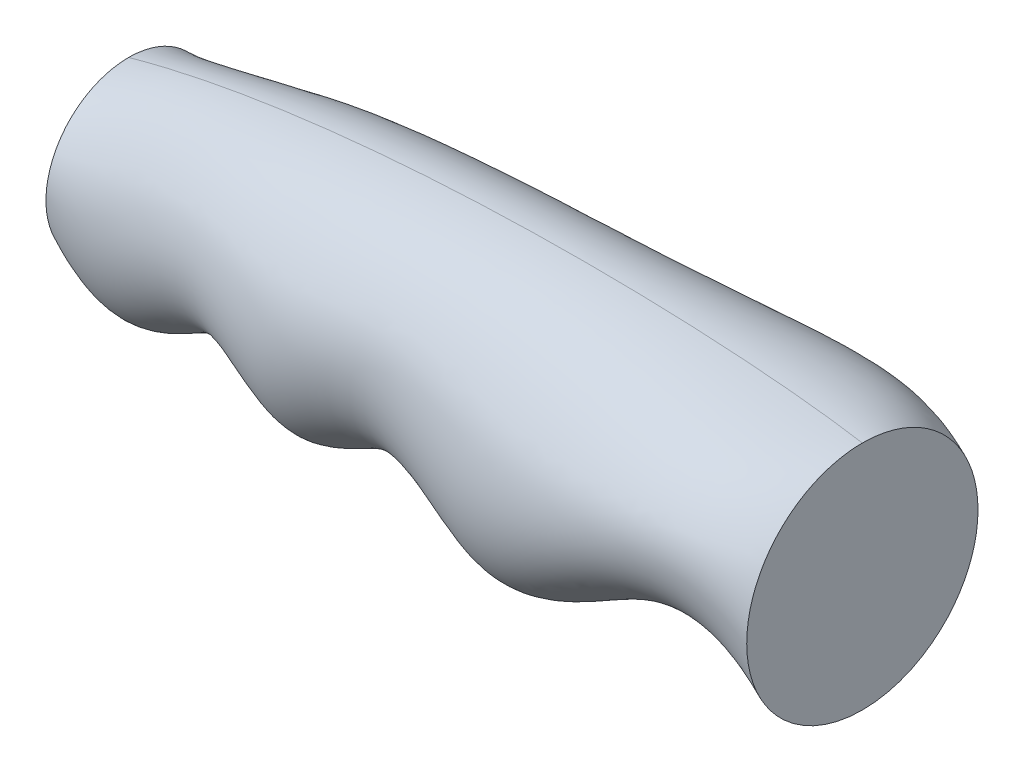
ISO-10303-21;
HEADER;
FILE_DESCRIPTION(('STEP AP214'),'2;1');
FILE_NAME('part.step','',(''),(''),'','','');
FILE_SCHEMA(('AUTOMOTIVE_DESIGN { 1 0 10303 214 1 1 1 1 }'));
ENDSEC;
DATA;
#1=APPLICATION_CONTEXT('core data for automotive mechanical design processes');
#2=APPLICATION_PROTOCOL_DEFINITION('international standard','automotive_design',2000,#1);
#3=PRODUCT_CONTEXT('',#1,'mechanical');
#4=PRODUCT('Part','Part','',(#3));
#5=PRODUCT_RELATED_PRODUCT_CATEGORY('part','',(#4));
#6=PRODUCT_DEFINITION_FORMATION('','',#4);
#7=PRODUCT_DEFINITION_CONTEXT('part definition',#1,'design');
#8=PRODUCT_DEFINITION('design','',#6,#7);
#9=PRODUCT_DEFINITION_SHAPE('','',#8);
#10=(LENGTH_UNIT() NAMED_UNIT(*) SI_UNIT(.MILLI.,.METRE.));
#11=(NAMED_UNIT(*) PLANE_ANGLE_UNIT() SI_UNIT($,.RADIAN.));
#12=(NAMED_UNIT(*) SI_UNIT($,.STERADIAN.) SOLID_ANGLE_UNIT());
#13=UNCERTAINTY_MEASURE_WITH_UNIT(LENGTH_MEASURE(1.E-05),#10,'distance_accuracy_value','');
#14=(GEOMETRIC_REPRESENTATION_CONTEXT(3) GLOBAL_UNCERTAINTY_ASSIGNED_CONTEXT((#13)) GLOBAL_UNIT_ASSIGNED_CONTEXT((#10,
#11,#12)) REPRESENTATION_CONTEXT('',''));
#15=CARTESIAN_POINT('',(0.,0.,0.));
#16=DIRECTION('',(0.,0.,1.));
#17=DIRECTION('',(1.,0.,0.));
#18=AXIS2_PLACEMENT_3D('',#15,#16,#17);
#19=CARTESIAN_POINT('',(0.,-45.081965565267,0.));
#20=CARTESIAN_POINT('',(0.,-45.081965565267,8.29380449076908));
#21=CARTESIAN_POINT('',(0.,-41.6852013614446,19.9543676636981));
#22=CARTESIAN_POINT('',(0.,-32.2670972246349,32.2170880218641));
#23=CARTESIAN_POINT('',(0.,-23.0550541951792,39.3406771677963));
#24=CARTESIAN_POINT('',(0.,-11.9906239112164,43.9597126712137));
#25=CARTESIAN_POINT('',(0.,0.,45.6430920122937));
#26=CARTESIAN_POINT('',(0.,11.9906239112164,43.9597126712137));
#27=CARTESIAN_POINT('',(0.,23.0550541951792,39.3406771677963));
#28=CARTESIAN_POINT('',(0.,32.2670972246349,32.2170880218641));
#29=CARTESIAN_POINT('',(0.,41.6852013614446,19.9543676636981));
#30=CARTESIAN_POINT('',(0.,45.081965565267,8.29380449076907));
#31=CARTESIAN_POINT('',(0.,45.081965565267,0.));
#32=CARTESIAN_POINT('',(25.4437798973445,-91.8123315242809,0.));
#33=CARTESIAN_POINT('',(25.4437798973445,-91.8123315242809,8.24710929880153));
#34=CARTESIAN_POINT('',(25.5036559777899,-86.1529244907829,19.8493034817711));
#35=CARTESIAN_POINT('',(25.6633255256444,-70.7011061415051,32.057546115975));
#36=CARTESIAN_POINT('',(25.813015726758,-55.8324560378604,39.1519507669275));
#37=CARTESIAN_POINT('',(25.9826646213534,-38.3572044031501,43.753475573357));
#38=CARTESIAN_POINT('',(26.1622928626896,-19.5786520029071,45.4310180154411));
#39=CARTESIAN_POINT('',(26.3419211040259,-0.800099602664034,43.753475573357));
#40=CARTESIAN_POINT('',(26.5115699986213,16.6751520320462,39.1519507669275));
#41=CARTESIAN_POINT('',(26.6612601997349,31.5438021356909,32.057546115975));
#42=CARTESIAN_POINT('',(26.8209297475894,46.9956204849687,19.8493034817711));
#43=CARTESIAN_POINT('',(26.8808058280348,52.6550275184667,8.24710929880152));
#44=CARTESIAN_POINT('',(26.8808058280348,52.6550275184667,0.));
#45=CARTESIAN_POINT('',(70.7801937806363,-12.7781376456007,0.));
#46=CARTESIAN_POINT('',(70.7801937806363,-12.7781376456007,8.23450328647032));
#47=CARTESIAN_POINT('',(70.8679625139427,-10.0750149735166,19.8902780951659));
#48=CARTESIAN_POINT('',(71.1020124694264,-2.40422636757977,32.2318708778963));
#49=CARTESIAN_POINT('',(71.3214343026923,5.18472441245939,39.4055532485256));
#50=CARTESIAN_POINT('',(71.5701123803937,14.3755701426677,44.0446345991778));
#51=CARTESIAN_POINT('',(71.8334185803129,24.3972145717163,45.7331018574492));
#52=CARTESIAN_POINT('',(72.0967247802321,34.418859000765,44.0446345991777));
#53=CARTESIAN_POINT('',(72.3454028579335,43.6097047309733,39.4055532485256));
#54=CARTESIAN_POINT('',(72.5648246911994,51.1986555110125,32.2318708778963));
#55=CARTESIAN_POINT('',(72.7988746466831,58.8694441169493,19.8902780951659));
#56=CARTESIAN_POINT('',(72.8866433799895,61.5725667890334,8.23450328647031));
#57=CARTESIAN_POINT('',(72.8866433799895,61.5725667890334,0.));
#58=CARTESIAN_POINT('',(126.144396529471,-83.0883194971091,0.));
#59=CARTESIAN_POINT('',(126.144396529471,-83.0883194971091,11.790936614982));
#60=CARTESIAN_POINT('',(126.731227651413,-77.2395672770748,28.0721356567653));
#61=CARTESIAN_POINT('',(128.296110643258,-60.9147913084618,44.9470024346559));
#62=CARTESIAN_POINT('',(129.763188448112,-45.1737715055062,54.5695639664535));
#63=CARTESIAN_POINT('',(131.425876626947,-26.832327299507,60.6520038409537));
#64=CARTESIAN_POINT('',(133.186369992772,-7.08337722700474,62.8174552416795));
#65=CARTESIAN_POINT('',(134.946863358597,12.6655728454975,60.6520038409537));
#66=CARTESIAN_POINT('',(136.609551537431,31.0070170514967,54.5695639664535));
#67=CARTESIAN_POINT('',(138.076629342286,46.7480368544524,44.9470024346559));
#68=CARTESIAN_POINT('',(139.64151233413,63.0728128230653,28.0721356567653));
#69=CARTESIAN_POINT('',(140.228343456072,68.9215650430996,11.790936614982));
#70=CARTESIAN_POINT('',(140.228343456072,68.9215650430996,0.));
#71=CARTESIAN_POINT('',(179.258015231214,-28.1176403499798,0.));
#72=CARTESIAN_POINT('',(179.258015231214,-28.1176403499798,9.51287421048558));
#73=CARTESIAN_POINT('',(180.071461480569,-24.5037436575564,23.1327139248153));
#74=CARTESIAN_POINT('',(182.24065147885,-13.8635836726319,37.7474724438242));
#75=CARTESIAN_POINT('',(184.274267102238,-3.41156331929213,46.1803176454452));
#76=CARTESIAN_POINT('',(186.57903147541,8.84415420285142,51.5220440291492));
#77=CARTESIAN_POINT('',(189.019370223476,22.1891842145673,53.4363099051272));
#78=CARTESIAN_POINT('',(191.459708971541,35.5342142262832,51.5220440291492));
#79=CARTESIAN_POINT('',(193.764473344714,47.7899317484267,46.1803176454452));
#80=CARTESIAN_POINT('',(195.798088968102,58.2419521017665,37.7474724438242));
#81=CARTESIAN_POINT('',(197.967278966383,68.8821120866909,23.1327139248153));
#82=CARTESIAN_POINT('',(198.780725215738,72.4960087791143,9.51287421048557));
#83=CARTESIAN_POINT('',(198.780725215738,72.4960087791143,0.));
#84=CARTESIAN_POINT('',(263.695574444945,-127.911870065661,0.));
#85=CARTESIAN_POINT('',(263.695574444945,-127.911870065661,14.3511095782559));
#86=CARTESIAN_POINT('',(265.139927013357,-120.25154973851,34.3621342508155));
#87=CARTESIAN_POINT('',(268.991533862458,-98.3138238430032,55.3547401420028));
#88=CARTESIAN_POINT('',(272.60241528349,-77.1959697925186,67.2431168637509));
#89=CARTESIAN_POINT('',(276.694747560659,-53.0210854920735,74.6085881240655));
#90=CARTESIAN_POINT('',(281.027805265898,-26.9823867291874,77.1895413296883));
#91=CARTESIAN_POINT('',(285.360862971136,-0.943687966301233,74.6085881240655));
#92=CARTESIAN_POINT('',(289.453195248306,23.2311963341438,67.2431168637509));
#93=CARTESIAN_POINT('',(293.064076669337,44.3490503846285,55.3547401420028));
#94=CARTESIAN_POINT('',(296.915683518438,66.286776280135,34.3621342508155));
#95=CARTESIAN_POINT('',(298.360036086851,73.9470966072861,14.3511095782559));
#96=CARTESIAN_POINT('',(298.360036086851,73.9470966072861,0.));
#97=CARTESIAN_POINT('',(343.132540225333,21.5708474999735,0.));
#98=CARTESIAN_POINT('',(343.132540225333,21.5708474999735,12.5788019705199));
#99=CARTESIAN_POINT('',(344.150844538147,22.6663414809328,30.5960338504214));
#100=CARTESIAN_POINT('',(346.866322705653,27.4250997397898,49.9941105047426));
#101=CARTESIAN_POINT('',(349.412083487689,32.4856601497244,61.0533307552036));
#102=CARTESIAN_POINT('',(352.297279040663,38.3533650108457,67.8893177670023));
#103=CARTESIAN_POINT('',(355.352191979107,45.0553403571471,70.2886819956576));
#104=CARTESIAN_POINT('',(358.40710491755,51.7573157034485,67.8893177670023));
#105=CARTESIAN_POINT('',(361.292300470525,57.6250205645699,61.0533307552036));
#106=CARTESIAN_POINT('',(363.838061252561,62.6855809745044,49.9941105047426));
#107=CARTESIAN_POINT('',(366.553539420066,67.4443392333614,30.5960338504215));
#108=CARTESIAN_POINT('',(367.571843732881,68.5398332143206,12.5788019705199));
#109=CARTESIAN_POINT('',(367.571843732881,68.5398332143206,0.));
#110=CARTESIAN_POINT('',(400.,-63.0429754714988,0.));
#111=CARTESIAN_POINT('',(400.,-63.0429754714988,11.1463756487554));
#112=CARTESIAN_POINT('',(400.,-58.6509412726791,27.3730746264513));
#113=CARTESIAN_POINT('',(400.,-45.1014090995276,45.0999872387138));
#114=CARTESIAN_POINT('',(400.,-31.799498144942,55.2639410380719));
#115=CARTESIAN_POINT('',(400.,-16.5915959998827,61.5627681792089));
#116=CARTESIAN_POINT('',(400.,0.,63.7830791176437));
#117=CARTESIAN_POINT('',(400.,16.5915959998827,61.562768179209));
#118=CARTESIAN_POINT('',(400.,31.799498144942,55.2639410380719));
#119=CARTESIAN_POINT('',(400.,45.1014090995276,45.0999872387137));
#120=CARTESIAN_POINT('',(400.,58.6509412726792,27.3730746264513));
#121=CARTESIAN_POINT('',(400.,63.0429754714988,11.1463756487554));
#122=CARTESIAN_POINT('',(400.,63.0429754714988,0.));
#123=B_SPLINE_SURFACE_WITH_KNOTS('',3,3,((#19,#20,#21,#22,#23,#24,#25,#26,#27,#28,#29,#30,#31),
(#32,#33,#34,#35,#36,#37,#38,#39,#40,#41,#42,#43,#44),(#45,#46,#47,#48,#49,#50,#51,#52,#53,#54,
#55,#56,#57),(#58,#59,#60,#61,#62,#63,#64,#65,#66,#67,#68,#69,#70),(#71,#72,#73,#74,#75,#76,#77,
#78,#79,#80,#81,#82,#83),(#84,#85,#86,#87,#88,#89,#90,#91,#92,#93,#94,#95,#96),(#97,#98,#99,
#100,#101,#102,#103,#104,#105,#106,#107,#108,#109),(#110,#111,#112,#113,#114,#115,#116,#117,
#118,#119,#120,#121,#122)),.UNSPECIFIED.,.F.,.F.,.F.,(4,1,1,1,1,4),(4,1,1,1,1,1,1,1,1,1,4),(0.,
0.212018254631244,0.326900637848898,0.4491786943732,0.597876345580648,1.),(0.,0.166666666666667,
0.25,0.333333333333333,0.416666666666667,0.5,0.583333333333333,0.666666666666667,0.75,
0.833333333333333,1.),.UNSPECIFIED.);
#124=CARTESIAN_POINT('',(0.,-45.081965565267,0.));
#125=CARTESIAN_POINT('',(25.4437798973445,-91.8123315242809,0.));
#126=CARTESIAN_POINT('',(70.7801937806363,-12.7781376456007,0.));
#127=CARTESIAN_POINT('',(126.144396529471,-83.0883194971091,0.));
#128=CARTESIAN_POINT('',(179.258015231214,-28.1176403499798,0.));
#129=CARTESIAN_POINT('',(263.695574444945,-127.911870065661,0.));
#130=CARTESIAN_POINT('',(343.132540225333,21.5708474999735,0.));
#131=CARTESIAN_POINT('',(400.,-63.0429754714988,0.));
#132=B_SPLINE_CURVE_WITH_KNOTS('',3,(#124,#125,#126,#127,#128,#129,#130,#131),.UNSPECIFIED.,.F.,
.F.,(4,1,1,1,1,4),(0.,0.212018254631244,0.326900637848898,0.4491786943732,0.597876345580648,1.),.UNSPECIFIED.);
#133=CARTESIAN_POINT('',(0.,-45.081965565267,0.));
#134=VERTEX_POINT('',#133);
#135=CARTESIAN_POINT('',(400.,-63.0429754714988,0.));
#136=VERTEX_POINT('',#135);
#137=EDGE_CURVE('E138',#134,#136,#132,.T.);
#138=CARTESIAN_POINT('',(400.,-63.0429754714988,0.));
#139=CARTESIAN_POINT('',(400.,-63.0429754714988,11.1463756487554));
#140=CARTESIAN_POINT('',(400.,-58.6509412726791,27.3730746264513));
#141=CARTESIAN_POINT('',(400.,-45.1014090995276,45.0999872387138));
#142=CARTESIAN_POINT('',(400.,-31.799498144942,55.2639410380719));
#143=CARTESIAN_POINT('',(400.,-16.5915959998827,61.5627681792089));
#144=CARTESIAN_POINT('',(400.,0.,63.7830791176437));
#145=CARTESIAN_POINT('',(400.,16.5915959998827,61.562768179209));
#146=CARTESIAN_POINT('',(400.,31.799498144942,55.2639410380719));
#147=CARTESIAN_POINT('',(400.,45.1014090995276,45.0999872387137));
#148=CARTESIAN_POINT('',(400.,58.6509412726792,27.3730746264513));
#149=CARTESIAN_POINT('',(400.,63.0429754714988,11.1463756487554));
#150=CARTESIAN_POINT('',(400.,63.0429754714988,0.));
#151=B_SPLINE_CURVE_WITH_KNOTS('',3,(#138,#139,#140,#141,#142,#143,#144,#145,#146,#147,#148,
#149,#150),.UNSPECIFIED.,.F.,.F.,(4,1,1,1,1,1,1,1,1,1,4),(0.,0.166666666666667,0.25,
0.333333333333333,0.416666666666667,0.5,0.583333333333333,0.666666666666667,0.75,
0.833333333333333,1.),.UNSPECIFIED.);
#152=CARTESIAN_POINT('',(400.,63.0429754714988,0.));
#153=VERTEX_POINT('',#152);
#154=EDGE_CURVE('E13',#136,#153,#151,.T.);
#155=CARTESIAN_POINT('',(400.,63.0429754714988,0.));
#156=CARTESIAN_POINT('',(319.357750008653,76.7125462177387,0.));
#157=CARTESIAN_POINT('',(126.785336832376,80.8008802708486,0.));
#158=CARTESIAN_POINT('',(0.,45.081965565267,0.));
#159=B_SPLINE_CURVE_WITH_KNOTS('',3,(#155,#156,#157,#158),.UNSPECIFIED.,.F.,.F.,(4,4),(0.,1.),.UNSPECIFIED.);
#160=CARTESIAN_POINT('',(0.,45.081965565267,0.));
#161=VERTEX_POINT('',#160);
#162=EDGE_CURVE('E178',#153,#161,#159,.T.);
#163=CARTESIAN_POINT('',(0.,-45.081965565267,0.));
#164=CARTESIAN_POINT('',(0.,-45.081965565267,8.29380449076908));
#165=CARTESIAN_POINT('',(0.,-41.6852013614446,19.9543676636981));
#166=CARTESIAN_POINT('',(0.,-32.2670972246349,32.2170880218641));
#167=CARTESIAN_POINT('',(0.,-23.0550541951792,39.3406771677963));
#168=CARTESIAN_POINT('',(0.,-11.9906239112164,43.9597126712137));
#169=CARTESIAN_POINT('',(0.,0.,45.6430920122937));
#170=CARTESIAN_POINT('',(0.,11.9906239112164,43.9597126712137));
#171=CARTESIAN_POINT('',(0.,23.0550541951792,39.3406771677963));
#172=CARTESIAN_POINT('',(0.,32.2670972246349,32.2170880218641));
#173=CARTESIAN_POINT('',(0.,41.6852013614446,19.9543676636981));
#174=CARTESIAN_POINT('',(0.,45.081965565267,8.29380449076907));
#175=CARTESIAN_POINT('',(0.,45.081965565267,0.));
#176=B_SPLINE_CURVE_WITH_KNOTS('',3,(#163,#164,#165,#166,#167,#168,#169,#170,#171,#172,#173,
#174,#175),.UNSPECIFIED.,.F.,.F.,(4,1,1,1,1,1,1,1,1,1,4),(0.,0.166666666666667,0.25,
0.333333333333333,0.416666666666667,0.5,0.583333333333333,0.666666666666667,0.75,
0.833333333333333,1.),.UNSPECIFIED.);
#177=EDGE_CURVE('E144',#161,#134,#176,.F.);
#178=ORIENTED_EDGE('',*,*,#137,.T.);
#179=ORIENTED_EDGE('',*,*,#154,.T.);
#180=ORIENTED_EDGE('',*,*,#162,.T.);
#181=ORIENTED_EDGE('',*,*,#177,.T.);
#182=EDGE_LOOP('',(#178,#179,#180,#181));
#183=FACE_BOUND('',#182,.T.);
#184=ADVANCED_FACE('F131',(#183),#123,.T.);
#185=CARTESIAN_POINT('',(400.,-63.0429754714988,0.));
#186=DIRECTION('',(1.,0.,0.));
#187=DIRECTION('',(0.,1.,0.));
#188=AXIS2_PLACEMENT_3D('',#185,#186,#187);
#189=PLANE('',#188);
#190=CARTESIAN_POINT('',(400.,-63.0429754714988,0.));
#191=CARTESIAN_POINT('',(400.,-63.0429754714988,-11.1463756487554));
#192=CARTESIAN_POINT('',(400.,-58.6509412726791,-27.3730746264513));
#193=CARTESIAN_POINT('',(400.,-45.1014090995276,-45.0999872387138));
#194=CARTESIAN_POINT('',(400.,-31.799498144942,-55.2639410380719));
#195=CARTESIAN_POINT('',(400.,-16.5915959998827,-61.5627681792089));
#196=CARTESIAN_POINT('',(400.,0.,-63.7830791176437));
#197=CARTESIAN_POINT('',(400.,16.5915959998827,-61.562768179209));
#198=CARTESIAN_POINT('',(400.,31.799498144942,-55.2639410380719));
#199=CARTESIAN_POINT('',(400.,45.1014090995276,-45.0999872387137));
#200=CARTESIAN_POINT('',(400.,58.6509412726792,-27.3730746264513));
#201=CARTESIAN_POINT('',(400.,63.0429754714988,-11.1463756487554));
#202=CARTESIAN_POINT('',(400.,63.0429754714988,0.));
#203=B_SPLINE_CURVE_WITH_KNOTS('',3,(#190,#191,#192,#193,#194,#195,#196,#197,#198,#199,#200,
#201,#202),.UNSPECIFIED.,.F.,.F.,(4,1,1,1,1,1,1,1,1,1,4),(0.,0.166666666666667,0.25,
0.333333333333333,0.416666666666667,0.5,0.583333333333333,0.666666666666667,0.75,
0.833333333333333,1.),.UNSPECIFIED.);
#204=EDGE_CURVE('E172',#136,#153,#203,.T.);
#205=ORIENTED_EDGE('',*,*,#204,.T.);
#206=ORIENTED_EDGE('',*,*,#154,.F.);
#207=EDGE_LOOP('',(#205,#206));
#208=FACE_BOUND('',#207,.T.);
#209=ADVANCED_FACE('F174',(#208),#189,.T.);
#210=CARTESIAN_POINT('',(0.,-17.1116215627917,0.));
#211=CARTESIAN_POINT('',(0.,-14.8477766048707,0.));
#212=CARTESIAN_POINT('',(0.,-11.4520091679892,0.));
#213=CARTESIAN_POINT('',(0.,-6.92431925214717,0.));
#214=CARTESIAN_POINT('',(0.,-3.52855181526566,0.));
#215=CARTESIAN_POINT('',(0.,-0.132784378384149,0.));
#216=CARTESIAN_POINT('',(0.,3.26298305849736,0.));
#217=CARTESIAN_POINT('',(0.,6.65875049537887,0.));
#218=CARTESIAN_POINT('',(0.,10.0545179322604,0.));
#219=CARTESIAN_POINT('',(0.,13.4502853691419,0.));
#220=CARTESIAN_POINT('',(0.,17.9779752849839,0.));
#221=CARTESIAN_POINT('',(0.,21.3737427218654,0.));
#222=CARTESIAN_POINT('',(0.,23.6375876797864,0.));
#223=CARTESIAN_POINT('',(0.,-26.4350695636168,0.));
#224=CARTESIAN_POINT('',(0.,-26.4350695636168,0.915087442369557));
#225=CARTESIAN_POINT('',(0.,-20.0891415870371,2.0589467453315));
#226=CARTESIAN_POINT('',(0.,-13.731276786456,3.12654876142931));
#227=CARTESIAN_POINT('',(0.,-8.61972039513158,3.69847841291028));
#228=CARTESIAN_POINT('',(0.,-3.27939214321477,4.04163620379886));
#229=CARTESIAN_POINT('',(0.,2.17532203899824,4.15602213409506));
#230=CARTESIAN_POINT('',(0.,7.63003622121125,4.04163620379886));
#231=CARTESIAN_POINT('',(0.,12.9703644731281,3.69847841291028));
#232=CARTESIAN_POINT('',(0.,18.0819208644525,3.12654876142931));
#233=CARTESIAN_POINT('',(0.,24.4397856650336,2.0589467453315));
#234=CARTESIAN_POINT('',(0.,30.7857136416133,0.915087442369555));
#235=CARTESIAN_POINT('',(0.,30.7857136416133,0.));
#236=CARTESIAN_POINT('',(0.,-35.7585175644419,0.));
#237=CARTESIAN_POINT('',(0.,-35.7585175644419,7.37871704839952));
#238=CARTESIAN_POINT('',(0.,-33.0480689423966,17.8954209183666));
#239=CARTESIAN_POINT('',(0.,-25.4601396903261,29.0905392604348));
#240=CARTESIAN_POINT('',(0.,-17.9638856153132,35.6421987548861));
#241=CARTESIAN_POINT('',(0.,-8.84401614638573,39.9180764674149));
#242=CARTESIAN_POINT('',(0.,1.08766101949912,41.4870698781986));
#243=CARTESIAN_POINT('',(0.,11.019338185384,39.9180764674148));
#244=CARTESIAN_POINT('',(0.,20.1392076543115,35.642198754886));
#245=CARTESIAN_POINT('',(0.,27.6354617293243,29.0905392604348));
#246=CARTESIAN_POINT('',(0.,35.2233909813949,17.8954209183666));
#247=CARTESIAN_POINT('',(0.,37.9338396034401,7.37871704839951));
#248=CARTESIAN_POINT('',(0.,37.9338396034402,0.));
#249=CARTESIAN_POINT('',(0.,-45.081965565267,0.));
#250=CARTESIAN_POINT('',(0.,-45.081965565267,8.29380449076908));
#251=CARTESIAN_POINT('',(0.,-41.6852013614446,19.9543676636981));
#252=CARTESIAN_POINT('',(0.,-32.2670972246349,32.2170880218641));
#253=CARTESIAN_POINT('',(0.,-23.0550541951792,39.3406771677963));
#254=CARTESIAN_POINT('',(0.,-11.9906239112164,43.9597126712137));
#255=CARTESIAN_POINT('',(0.,0.,45.6430920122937));
#256=CARTESIAN_POINT('',(0.,11.9906239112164,43.9597126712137));
#257=CARTESIAN_POINT('',(0.,23.0550541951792,39.3406771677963));
#258=CARTESIAN_POINT('',(0.,32.2670972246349,32.2170880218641));
#259=CARTESIAN_POINT('',(0.,41.6852013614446,19.9543676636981));
#260=CARTESIAN_POINT('',(0.,45.081965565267,8.29380449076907));
#261=CARTESIAN_POINT('',(0.,45.081965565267,0.));
#262=B_SPLINE_SURFACE_WITH_KNOTS('',3,3,((#210,#211,#212,#213,#214,#215,#216,#217,#218,#219,
#220,#221,#222),(#223,#224,#225,#226,#227,#228,#229,#230,#231,#232,#233,#234,#235),(#236,#237,
#238,#239,#240,#241,#242,#243,#244,#245,#246,#247,#248),(#249,#250,#251,#252,#253,#254,#255,
#256,#257,#258,#259,#260,#261)),.UNSPECIFIED.,.F.,.F.,.F.,(4,4),(4,1,1,1,1,1,1,1,1,1,4),(0.,1.),
(0.,0.166666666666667,0.25,0.333333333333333,0.416666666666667,0.5,0.583333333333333,
0.666666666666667,0.75,0.833333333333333,1.),.UNSPECIFIED.);
#263=DIRECTION('',(0.,-1.,0.));
#264=VECTOR('',#263,1.);
#265=CARTESIAN_POINT('',(0.,-17.1116215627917,0.));
#266=LINE('',#265,#264);
#267=CARTESIAN_POINT('',(0.,-17.1116215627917,0.));
#268=VERTEX_POINT('',#267);
#269=EDGE_CURVE('E160',#268,#134,#266,.T.);
#270=DIRECTION('',(0.,-1.,0.));
#271=VECTOR('',#270,1.);
#272=CARTESIAN_POINT('',(0.,23.6375876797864,0.));
#273=LINE('',#272,#271);
#274=CARTESIAN_POINT('',(0.,23.6375876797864,0.));
#275=VERTEX_POINT('',#274);
#276=EDGE_CURVE('E186',#161,#275,#273,.T.);
#277=DIRECTION('',(0.,1.,0.));
#278=VECTOR('',#277,1.);
#279=CARTESIAN_POINT('',(0.,3.26298305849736,0.));
#280=LINE('',#279,#278);
#281=EDGE_CURVE('E262',#268,#275,#280,.T.);
#282=ORIENTED_EDGE('',*,*,#269,.T.);
#283=ORIENTED_EDGE('',*,*,#177,.F.);
#284=ORIENTED_EDGE('',*,*,#276,.T.);
#285=ORIENTED_EDGE('',*,*,#281,.F.);
#286=EDGE_LOOP('',(#282,#283,#284,#285));
#287=FACE_BOUND('',#286,.T.);
#288=ADVANCED_FACE('F133',(#287),#262,.T.);
#289=CARTESIAN_POINT('',(0.,-45.081965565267,0.));
#290=CARTESIAN_POINT('',(0.,-45.081965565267,-8.29380449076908));
#291=CARTESIAN_POINT('',(0.,-41.6852013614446,-19.9543676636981));
#292=CARTESIAN_POINT('',(0.,-32.2670972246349,-32.2170880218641));
#293=CARTESIAN_POINT('',(0.,-23.0550541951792,-39.3406771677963));
#294=CARTESIAN_POINT('',(0.,-11.9906239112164,-43.9597126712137));
#295=CARTESIAN_POINT('',(0.,0.,-45.6430920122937));
#296=CARTESIAN_POINT('',(0.,11.9906239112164,-43.9597126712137));
#297=CARTESIAN_POINT('',(0.,23.0550541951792,-39.3406771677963));
#298=CARTESIAN_POINT('',(0.,32.2670972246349,-32.2170880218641));
#299=CARTESIAN_POINT('',(0.,41.6852013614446,-19.9543676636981));
#300=CARTESIAN_POINT('',(0.,45.081965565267,-8.29380449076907));
#301=CARTESIAN_POINT('',(0.,45.081965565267,0.));
#302=CARTESIAN_POINT('',(25.4437798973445,-91.8123315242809,0.));
#303=CARTESIAN_POINT('',(25.4437798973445,-91.8123315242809,-8.24710929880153));
#304=CARTESIAN_POINT('',(25.5036559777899,-86.1529244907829,-19.8493034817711));
#305=CARTESIAN_POINT('',(25.6633255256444,-70.7011061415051,-32.057546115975));
#306=CARTESIAN_POINT('',(25.813015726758,-55.8324560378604,-39.1519507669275));
#307=CARTESIAN_POINT('',(25.9826646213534,-38.3572044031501,-43.753475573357));
#308=CARTESIAN_POINT('',(26.1622928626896,-19.5786520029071,-45.4310180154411));
#309=CARTESIAN_POINT('',(26.3419211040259,-0.800099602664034,-43.753475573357));
#310=CARTESIAN_POINT('',(26.5115699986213,16.6751520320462,-39.1519507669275));
#311=CARTESIAN_POINT('',(26.6612601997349,31.5438021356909,-32.057546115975));
#312=CARTESIAN_POINT('',(26.8209297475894,46.9956204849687,-19.8493034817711));
#313=CARTESIAN_POINT('',(26.8808058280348,52.6550275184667,-8.24710929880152));
#314=CARTESIAN_POINT('',(26.8808058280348,52.6550275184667,0.));
#315=CARTESIAN_POINT('',(70.7801937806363,-12.7781376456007,0.));
#316=CARTESIAN_POINT('',(70.7801937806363,-12.7781376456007,-8.23450328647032));
#317=CARTESIAN_POINT('',(70.8679625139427,-10.0750149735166,-19.8902780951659));
#318=CARTESIAN_POINT('',(71.1020124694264,-2.40422636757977,-32.2318708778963));
#319=CARTESIAN_POINT('',(71.3214343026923,5.18472441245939,-39.4055532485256));
#320=CARTESIAN_POINT('',(71.5701123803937,14.3755701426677,-44.0446345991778));
#321=CARTESIAN_POINT('',(71.8334185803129,24.3972145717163,-45.7331018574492));
#322=CARTESIAN_POINT('',(72.0967247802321,34.418859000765,-44.0446345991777));
#323=CARTESIAN_POINT('',(72.3454028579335,43.6097047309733,-39.4055532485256));
#324=CARTESIAN_POINT('',(72.5648246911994,51.1986555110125,-32.2318708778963));
#325=CARTESIAN_POINT('',(72.7988746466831,58.8694441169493,-19.8902780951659));
#326=CARTESIAN_POINT('',(72.8866433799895,61.5725667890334,-8.23450328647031));
#327=CARTESIAN_POINT('',(72.8866433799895,61.5725667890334,0.));
#328=CARTESIAN_POINT('',(126.144396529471,-83.0883194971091,0.));
#329=CARTESIAN_POINT('',(126.144396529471,-83.0883194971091,-11.790936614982));
#330=CARTESIAN_POINT('',(126.731227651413,-77.2395672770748,-28.0721356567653));
#331=CARTESIAN_POINT('',(128.296110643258,-60.9147913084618,-44.9470024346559));
#332=CARTESIAN_POINT('',(129.763188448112,-45.1737715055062,-54.5695639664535));
#333=CARTESIAN_POINT('',(131.425876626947,-26.832327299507,-60.6520038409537));
#334=CARTESIAN_POINT('',(133.186369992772,-7.08337722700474,-62.8174552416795));
#335=CARTESIAN_POINT('',(134.946863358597,12.6655728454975,-60.6520038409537));
#336=CARTESIAN_POINT('',(136.609551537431,31.0070170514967,-54.5695639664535));
#337=CARTESIAN_POINT('',(138.076629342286,46.7480368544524,-44.9470024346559));
#338=CARTESIAN_POINT('',(139.64151233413,63.0728128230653,-28.0721356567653));
#339=CARTESIAN_POINT('',(140.228343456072,68.9215650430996,-11.790936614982));
#340=CARTESIAN_POINT('',(140.228343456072,68.9215650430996,0.));
#341=CARTESIAN_POINT('',(179.258015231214,-28.1176403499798,0.));
#342=CARTESIAN_POINT('',(179.258015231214,-28.1176403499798,-9.51287421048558));
#343=CARTESIAN_POINT('',(180.071461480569,-24.5037436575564,-23.1327139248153));
#344=CARTESIAN_POINT('',(182.24065147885,-13.8635836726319,-37.7474724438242));
#345=CARTESIAN_POINT('',(184.274267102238,-3.41156331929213,-46.1803176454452));
#346=CARTESIAN_POINT('',(186.57903147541,8.84415420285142,-51.5220440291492));
#347=CARTESIAN_POINT('',(189.019370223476,22.1891842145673,-53.4363099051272));
#348=CARTESIAN_POINT('',(191.459708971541,35.5342142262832,-51.5220440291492));
#349=CARTESIAN_POINT('',(193.764473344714,47.7899317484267,-46.1803176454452));
#350=CARTESIAN_POINT('',(195.798088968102,58.2419521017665,-37.7474724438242));
#351=CARTESIAN_POINT('',(197.967278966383,68.8821120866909,-23.1327139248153));
#352=CARTESIAN_POINT('',(198.780725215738,72.4960087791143,-9.51287421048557));
#353=CARTESIAN_POINT('',(198.780725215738,72.4960087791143,0.));
#354=CARTESIAN_POINT('',(263.695574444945,-127.911870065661,0.));
#355=CARTESIAN_POINT('',(263.695574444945,-127.911870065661,-14.3511095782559));
#356=CARTESIAN_POINT('',(265.139927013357,-120.25154973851,-34.3621342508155));
#357=CARTESIAN_POINT('',(268.991533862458,-98.3138238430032,-55.3547401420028));
#358=CARTESIAN_POINT('',(272.60241528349,-77.1959697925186,-67.2431168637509));
#359=CARTESIAN_POINT('',(276.694747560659,-53.0210854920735,-74.6085881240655));
#360=CARTESIAN_POINT('',(281.027805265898,-26.9823867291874,-77.1895413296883));
#361=CARTESIAN_POINT('',(285.360862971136,-0.943687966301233,-74.6085881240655));
#362=CARTESIAN_POINT('',(289.453195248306,23.2311963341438,-67.2431168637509));
#363=CARTESIAN_POINT('',(293.064076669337,44.3490503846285,-55.3547401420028));
#364=CARTESIAN_POINT('',(296.915683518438,66.286776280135,-34.3621342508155));
#365=CARTESIAN_POINT('',(298.360036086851,73.9470966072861,-14.3511095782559));
#366=CARTESIAN_POINT('',(298.360036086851,73.9470966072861,0.));
#367=CARTESIAN_POINT('',(343.132540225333,21.5708474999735,0.));
#368=CARTESIAN_POINT('',(343.132540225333,21.5708474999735,-12.5788019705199));
#369=CARTESIAN_POINT('',(344.150844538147,22.6663414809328,-30.5960338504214));
#370=CARTESIAN_POINT('',(346.866322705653,27.4250997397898,-49.9941105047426));
#371=CARTESIAN_POINT('',(349.412083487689,32.4856601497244,-61.0533307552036));
#372=CARTESIAN_POINT('',(352.297279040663,38.3533650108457,-67.8893177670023));
#373=CARTESIAN_POINT('',(355.352191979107,45.0553403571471,-70.2886819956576));
#374=CARTESIAN_POINT('',(358.40710491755,51.7573157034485,-67.8893177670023));
#375=CARTESIAN_POINT('',(361.292300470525,57.6250205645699,-61.0533307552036));
#376=CARTESIAN_POINT('',(363.838061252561,62.6855809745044,-49.9941105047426));
#377=CARTESIAN_POINT('',(366.553539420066,67.4443392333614,-30.5960338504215));
#378=CARTESIAN_POINT('',(367.571843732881,68.5398332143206,-12.5788019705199));
#379=CARTESIAN_POINT('',(367.571843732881,68.5398332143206,0.));
#380=CARTESIAN_POINT('',(400.,-63.0429754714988,0.));
#381=CARTESIAN_POINT('',(400.,-63.0429754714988,-11.1463756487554));
#382=CARTESIAN_POINT('',(400.,-58.6509412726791,-27.3730746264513));
#383=CARTESIAN_POINT('',(400.,-45.1014090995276,-45.0999872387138));
#384=CARTESIAN_POINT('',(400.,-31.799498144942,-55.2639410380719));
#385=CARTESIAN_POINT('',(400.,-16.5915959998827,-61.5627681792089));
#386=CARTESIAN_POINT('',(400.,0.,-63.7830791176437));
#387=CARTESIAN_POINT('',(400.,16.5915959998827,-61.562768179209));
#388=CARTESIAN_POINT('',(400.,31.799498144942,-55.2639410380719));
#389=CARTESIAN_POINT('',(400.,45.1014090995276,-45.0999872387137));
#390=CARTESIAN_POINT('',(400.,58.6509412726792,-27.3730746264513));
#391=CARTESIAN_POINT('',(400.,63.0429754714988,-11.1463756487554));
#392=CARTESIAN_POINT('',(400.,63.0429754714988,0.));
#393=B_SPLINE_SURFACE_WITH_KNOTS('',3,3,((#289,#290,#291,#292,#293,#294,#295,#296,#297,#298,
#299,#300,#301),(#302,#303,#304,#305,#306,#307,#308,#309,#310,#311,#312,#313,#314),(#315,#316,
#317,#318,#319,#320,#321,#322,#323,#324,#325,#326,#327),(#328,#329,#330,#331,#332,#333,#334,
#335,#336,#337,#338,#339,#340),(#341,#342,#343,#344,#345,#346,#347,#348,#349,#350,#351,#352,
#353),(#354,#355,#356,#357,#358,#359,#360,#361,#362,#363,#364,#365,#366),(#367,#368,#369,#370,
#371,#372,#373,#374,#375,#376,#377,#378,#379),(#380,#381,#382,#383,#384,#385,#386,#387,#388,
#389,#390,#391,#392)),.UNSPECIFIED.,.F.,.F.,.F.,(4,1,1,1,1,4),(4,1,1,1,1,1,1,1,1,1,4),(0.,
0.212018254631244,0.326900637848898,0.4491786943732,0.597876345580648,1.),(0.,0.166666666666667,
0.25,0.333333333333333,0.416666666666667,0.5,0.583333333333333,0.666666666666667,0.75,
0.833333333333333,1.),.UNSPECIFIED.);
#394=CARTESIAN_POINT('',(0.,-45.081965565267,0.));
#395=CARTESIAN_POINT('',(0.,-45.081965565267,-8.29380449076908));
#396=CARTESIAN_POINT('',(0.,-41.6852013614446,-19.9543676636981));
#397=CARTESIAN_POINT('',(0.,-32.2670972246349,-32.2170880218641));
#398=CARTESIAN_POINT('',(0.,-23.0550541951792,-39.3406771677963));
#399=CARTESIAN_POINT('',(0.,-11.9906239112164,-43.9597126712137));
#400=CARTESIAN_POINT('',(0.,0.,-45.6430920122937));
#401=CARTESIAN_POINT('',(0.,11.9906239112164,-43.9597126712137));
#402=CARTESIAN_POINT('',(0.,23.0550541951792,-39.3406771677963));
#403=CARTESIAN_POINT('',(0.,32.2670972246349,-32.2170880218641));
#404=CARTESIAN_POINT('',(0.,41.6852013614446,-19.9543676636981));
#405=CARTESIAN_POINT('',(0.,45.081965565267,-8.29380449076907));
#406=CARTESIAN_POINT('',(0.,45.081965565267,0.));
#407=B_SPLINE_CURVE_WITH_KNOTS('',3,(#394,#395,#396,#397,#398,#399,#400,#401,#402,#403,#404,
#405,#406),.UNSPECIFIED.,.F.,.F.,(4,1,1,1,1,1,1,1,1,1,4),(0.,0.166666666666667,0.25,
0.333333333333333,0.416666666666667,0.5,0.583333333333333,0.666666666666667,0.75,
0.833333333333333,1.),.UNSPECIFIED.);
#408=EDGE_CURVE('E175',#161,#134,#407,.F.);
#409=ORIENTED_EDGE('',*,*,#137,.F.);
#410=ORIENTED_EDGE('',*,*,#408,.F.);
#411=ORIENTED_EDGE('',*,*,#162,.F.);
#412=ORIENTED_EDGE('',*,*,#204,.F.);
#413=EDGE_LOOP('',(#409,#410,#411,#412));
#414=FACE_BOUND('',#413,.T.);
#415=ADVANCED_FACE('F180',(#414),#393,.F.);
#416=CARTESIAN_POINT('',(0.,-17.1116215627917,0.));
#417=CARTESIAN_POINT('',(0.,-14.8477766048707,0.));
#418=CARTESIAN_POINT('',(0.,-11.4520091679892,0.));
#419=CARTESIAN_POINT('',(0.,-6.92431925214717,0.));
#420=CARTESIAN_POINT('',(0.,-3.52855181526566,0.));
#421=CARTESIAN_POINT('',(0.,-0.132784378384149,0.));
#422=CARTESIAN_POINT('',(0.,3.26298305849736,0.));
#423=CARTESIAN_POINT('',(0.,6.65875049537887,0.));
#424=CARTESIAN_POINT('',(0.,10.0545179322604,0.));
#425=CARTESIAN_POINT('',(0.,13.4502853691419,0.));
#426=CARTESIAN_POINT('',(0.,17.9779752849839,0.));
#427=CARTESIAN_POINT('',(0.,21.3737427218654,0.));
#428=CARTESIAN_POINT('',(0.,23.6375876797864,0.));
#429=CARTESIAN_POINT('',(0.,-26.4350695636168,0.));
#430=CARTESIAN_POINT('',(0.,-26.4350695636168,-0.915087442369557));
#431=CARTESIAN_POINT('',(0.,-20.0891415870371,-2.0589467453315));
#432=CARTESIAN_POINT('',(0.,-13.731276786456,-3.12654876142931));
#433=CARTESIAN_POINT('',(0.,-8.61972039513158,-3.69847841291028));
#434=CARTESIAN_POINT('',(0.,-3.27939214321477,-4.04163620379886));
#435=CARTESIAN_POINT('',(0.,2.17532203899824,-4.15602213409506));
#436=CARTESIAN_POINT('',(0.,7.63003622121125,-4.04163620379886));
#437=CARTESIAN_POINT('',(0.,12.9703644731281,-3.69847841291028));
#438=CARTESIAN_POINT('',(0.,18.0819208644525,-3.12654876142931));
#439=CARTESIAN_POINT('',(0.,24.4397856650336,-2.0589467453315));
#440=CARTESIAN_POINT('',(0.,30.7857136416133,-0.915087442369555));
#441=CARTESIAN_POINT('',(0.,30.7857136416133,0.));
#442=CARTESIAN_POINT('',(0.,-35.7585175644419,0.));
#443=CARTESIAN_POINT('',(0.,-35.7585175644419,-7.37871704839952));
#444=CARTESIAN_POINT('',(0.,-33.0480689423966,-17.8954209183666));
#445=CARTESIAN_POINT('',(0.,-25.4601396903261,-29.0905392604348));
#446=CARTESIAN_POINT('',(0.,-17.9638856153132,-35.6421987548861));
#447=CARTESIAN_POINT('',(0.,-8.84401614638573,-39.9180764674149));
#448=CARTESIAN_POINT('',(0.,1.08766101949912,-41.4870698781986));
#449=CARTESIAN_POINT('',(0.,11.019338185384,-39.9180764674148));
#450=CARTESIAN_POINT('',(0.,20.1392076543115,-35.642198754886));
#451=CARTESIAN_POINT('',(0.,27.6354617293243,-29.0905392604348));
#452=CARTESIAN_POINT('',(0.,35.2233909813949,-17.8954209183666));
#453=CARTESIAN_POINT('',(0.,37.9338396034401,-7.37871704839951));
#454=CARTESIAN_POINT('',(0.,37.9338396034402,0.));
#455=CARTESIAN_POINT('',(0.,-45.081965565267,0.));
#456=CARTESIAN_POINT('',(0.,-45.081965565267,-8.29380449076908));
#457=CARTESIAN_POINT('',(0.,-41.6852013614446,-19.9543676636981));
#458=CARTESIAN_POINT('',(0.,-32.2670972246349,-32.2170880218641));
#459=CARTESIAN_POINT('',(0.,-23.0550541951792,-39.3406771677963));
#460=CARTESIAN_POINT('',(0.,-11.9906239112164,-43.9597126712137));
#461=CARTESIAN_POINT('',(0.,0.,-45.6430920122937));
#462=CARTESIAN_POINT('',(0.,11.9906239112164,-43.9597126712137));
#463=CARTESIAN_POINT('',(0.,23.0550541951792,-39.3406771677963));
#464=CARTESIAN_POINT('',(0.,32.2670972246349,-32.2170880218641));
#465=CARTESIAN_POINT('',(0.,41.6852013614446,-19.9543676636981));
#466=CARTESIAN_POINT('',(0.,45.081965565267,-8.29380449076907));
#467=CARTESIAN_POINT('',(0.,45.081965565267,0.));
#468=B_SPLINE_SURFACE_WITH_KNOTS('',3,3,((#416,#417,#418,#419,#420,#421,#422,#423,#424,#425,
#426,#427,#428),(#429,#430,#431,#432,#433,#434,#435,#436,#437,#438,#439,#440,#441),(#442,#443,
#444,#445,#446,#447,#448,#449,#450,#451,#452,#453,#454),(#455,#456,#457,#458,#459,#460,#461,
#462,#463,#464,#465,#466,#467)),.UNSPECIFIED.,.F.,.F.,.F.,(4,4),(4,1,1,1,1,1,1,1,1,1,4),(0.,1.),
(0.,0.166666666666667,0.25,0.333333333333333,0.416666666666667,0.5,0.583333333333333,
0.666666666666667,0.75,0.833333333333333,1.),.UNSPECIFIED.);
#469=ORIENTED_EDGE('',*,*,#269,.F.);
#470=ORIENTED_EDGE('',*,*,#281,.T.);
#471=ORIENTED_EDGE('',*,*,#276,.F.);
#472=ORIENTED_EDGE('',*,*,#408,.T.);
#473=EDGE_LOOP('',(#469,#470,#471,#472));
#474=FACE_BOUND('',#473,.T.);
#475=ADVANCED_FACE('F210',(#474),#468,.F.);
#476=CLOSED_SHELL('',(#184,#209,#288,#415,#475));
#477=MANIFOLD_SOLID_BREP('B2',#476);
#478=ADVANCED_BREP_SHAPE_REPRESENTATION('',(#18,#477),#14);
#479=SHAPE_DEFINITION_REPRESENTATION(#9,#478);
ENDSEC;
END-ISO-10303-21;
